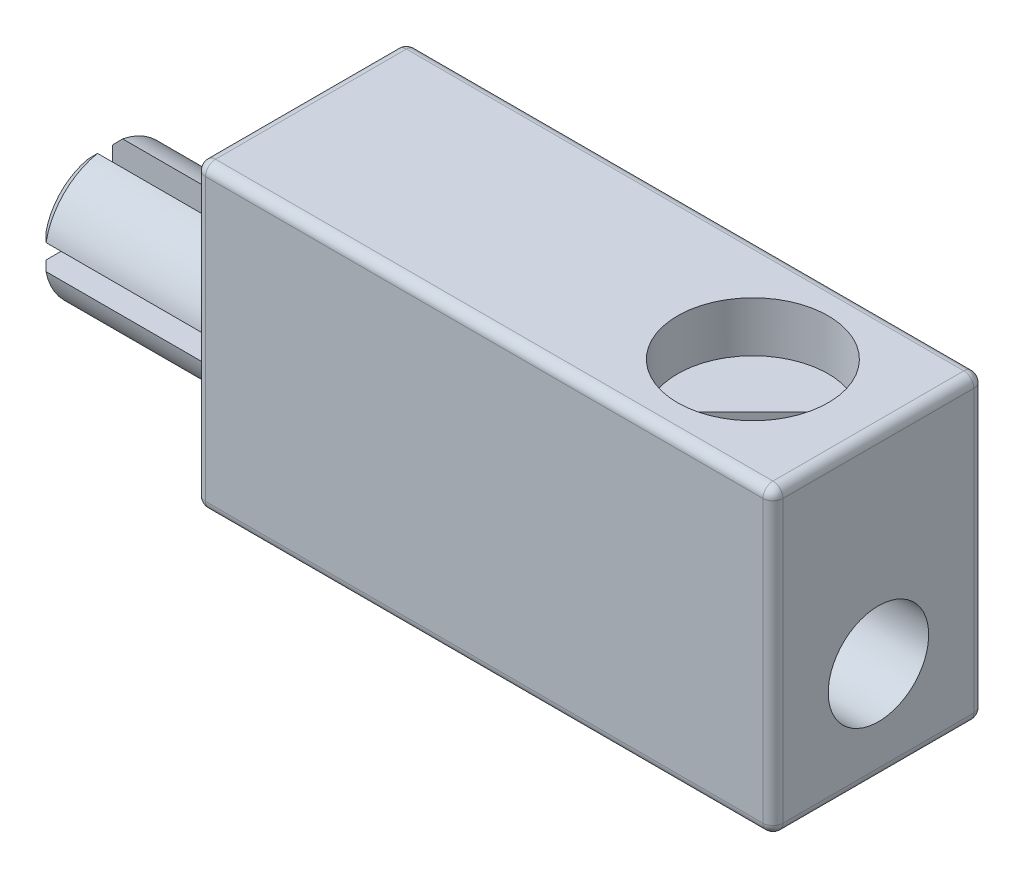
from build123d import *
from build123d.topology import SkipClean

# Parameters (mm, degrees)
SKETCH_1_W          = 11.5
SKETCH_1_H          = 6
EXTRUDE_1_DEPTH     = 4.2
SKETCH_2_R          = 1.5
CUT_EXTRUDE_1_DEPTH = 2
SKETCH_3_R          = 1.3
EXTRUDE_2_DEPTH     = 6
CHAMFER_1_SIZE      = 0.2
CUT_EXTRUDE_START   = -5
CUT_EXTRUDE_2_DEPTH = 5
SKETCH_5_R          = 1
CUT_EXTRUDE_3_DEPTH = 9
SKETCH_6_R          = 1.3
CUT_EXTRUDE_4_DEPTH = 2
SKETCH_7_R          = 1.5
CUT_EXTRUDE_5_DEPTH = 1
CUT_EXTRUDE_6_DEPTH = 0.5
EXTRUDE_START       = -3
SKETCH_9_R          = 0.7
EXTRUDE_3_DEPTH     = 1.6
FILLET_1_R          = 0.2


with BuildPart() as part:
    # Sketch 1 → Extrude 1 (new body)
    with BuildSketch(Plane.XY):
        with Locations((5.75, 3)):
            Rectangle(SKETCH_1_W, SKETCH_1_H)
    extrude(amount=EXTRUDE_1_DEPTH)

    # Sketch 2 → Cut-Extrude 1 (cut)
    with BuildSketch(Plane.ZY):
        with Locations((2.1, 2)):
            Circle(SKETCH_2_R)
    extrude(amount=-CUT_EXTRUDE_1_DEPTH, mode=Mode.SUBTRACT)

    # Sketch 3 → Extrude 2 (add)
    with BuildSketch(Plane.ZY.offset(-2)):
        with Locations((2.1, 2)):
            Circle(SKETCH_3_R)
    extrude(amount=EXTRUDE_2_DEPTH)

    # Chamfer 1
    chamfer_1_edges = [part.edges().sort_by_distance(p)[0] for p in [
        (-4, 2, 0.8),
    ]]
    chamfer(chamfer_1_edges, length=CHAMFER_1_SIZE)

    # Sketch 4 → Cut-Extrude 2 (cut)
    with BuildSketch(Plane.ZY.offset(4).offset(CUT_EXTRUDE_START)):
        with BuildLine():
            Line((1.85, 3.275735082), (1.85, 2.25))
            Line((1.85, 2.25), (0.824264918, 2.25))
            ThreePointArc((0.824264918, 2.25), (0.8, 2), (0.824264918, 1.75))
            Line((0.824264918, 1.75), (1.85, 1.75))
            Line((1.85, 1.75), (1.85, 0.724264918))
            ThreePointArc((1.85, 0.724264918), (2.1, 0.7), (2.35, 0.724264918))
            Line((2.35, 0.724264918), (2.35, 1.75))
            Line((2.35, 1.75), (3.375735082, 1.75))
            ThreePointArc((3.375735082, 1.75), (3.4, 2), (3.375735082, 2.25))
            Line((3.375735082, 2.25), (2.35, 2.25))
            Line((2.35, 2.25), (2.35, 3.275735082))
            ThreePointArc((2.35, 3.275735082), (2.1, 3.3), (1.85, 3.275735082))
        make_face()
    extrude(amount=CUT_EXTRUDE_2_DEPTH, mode=Mode.SUBTRACT)

    # Sketch 5 → Cut-Extrude 3 (cut)
    with BuildSketch(Plane(origin=(11.5, 0, 0), x_dir=(0, 0, -1), z_dir=(1, 0, 0))):
        with Locations(Location((-2.1, 2, 0), (0, 0, 90))):
            Circle(SKETCH_5_R)
    extrude(amount=-CUT_EXTRUDE_3_DEPTH, mode=Mode.SUBTRACT)

    # Sketch 6 → Cut-Extrude 4 (cut)
    with BuildSketch(Plane.XZ):
        with Locations(Location((4.5, 2.1, 0), (0, 0, 270))):
            Circle(SKETCH_6_R)
    extrude(amount=-CUT_EXTRUDE_4_DEPTH, mode=Mode.SUBTRACT)

    # Sketch 7 → Cut-Extrude 5 (cut)
    with BuildSketch(Plane(origin=(0, 6, 0), x_dir=(1, 0, 0), z_dir=(0, 1, 0))):
        with Locations(Location((9, -2.1, 0), (0, 0, 270))):
            Circle(SKETCH_7_R)
    extrude(amount=-CUT_EXTRUDE_5_DEPTH, mode=Mode.SUBTRACT)

    # Sketch 8 → Cut-Extrude 6 (cut)
    with SkipClean():  # the faces are left unmerged after this step: merging them gives an invalid solid
        with BuildSketch(Plane(origin=(0, 5, 0), x_dir=(1, 0, 0), z_dir=(0, 1, 0))):
            with BuildLine():
                Line((9.088388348, -2.188388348), (8.03141744, -3.245359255))
                ThreePointArc((8.03141744, -3.245359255), (7.939339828, -3.160660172), (7.854640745, -3.06858256))
                Line((7.854640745, -3.06858256), (8.911611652, -2.011611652))
                Line((8.911611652, -2.011611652), (9.96858256, -0.954640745))
                ThreePointArc((9.96858256, -0.954640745), (10.060660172, -1.039339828), (10.145359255, -1.13141744))
                Line((10.145359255, -1.13141744), (9.088388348, -2.188388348))
            make_face()
        extrude(amount=-CUT_EXTRUDE_6_DEPTH, mode=Mode.SUBTRACT)

    # Sketch 9 → Extrude 3 (add)
    with SkipClean():  # the faces are left unmerged after this step: merging them gives an invalid solid
        with BuildSketch(Plane(origin=(0, 6, 0), x_dir=(1, 0, 0), z_dir=(0, 1, 0)).offset(EXTRUDE_START)):
            with Locations(Location((9, -2.1, 0), (0, 0, 270))):
                Circle(SKETCH_9_R)
        extrude(amount=-EXTRUDE_3_DEPTH)

    # Fillet 1
    fillet_1_edges = [part.edges().sort_by_distance(p)[0] for p in [
        (11.5, 3, 4.2),
        (5.75, 6, 4.2),
        (0, 3, 4.2),
        (5.75, 6, 0),
        (11.5, 3, 0),
        (5.75, 0, 0),
        (0, 3, 0),
        (5.75, 0, 4.2),
        (0, 6, 2.1),
        (11.5, 6, 2.1),
        (11.5, 0, 2.1),
        (0, 0, 2.1),
    ]]
    fillet(fillet_1_edges, radius=FILLET_1_R)


solid = part.part
